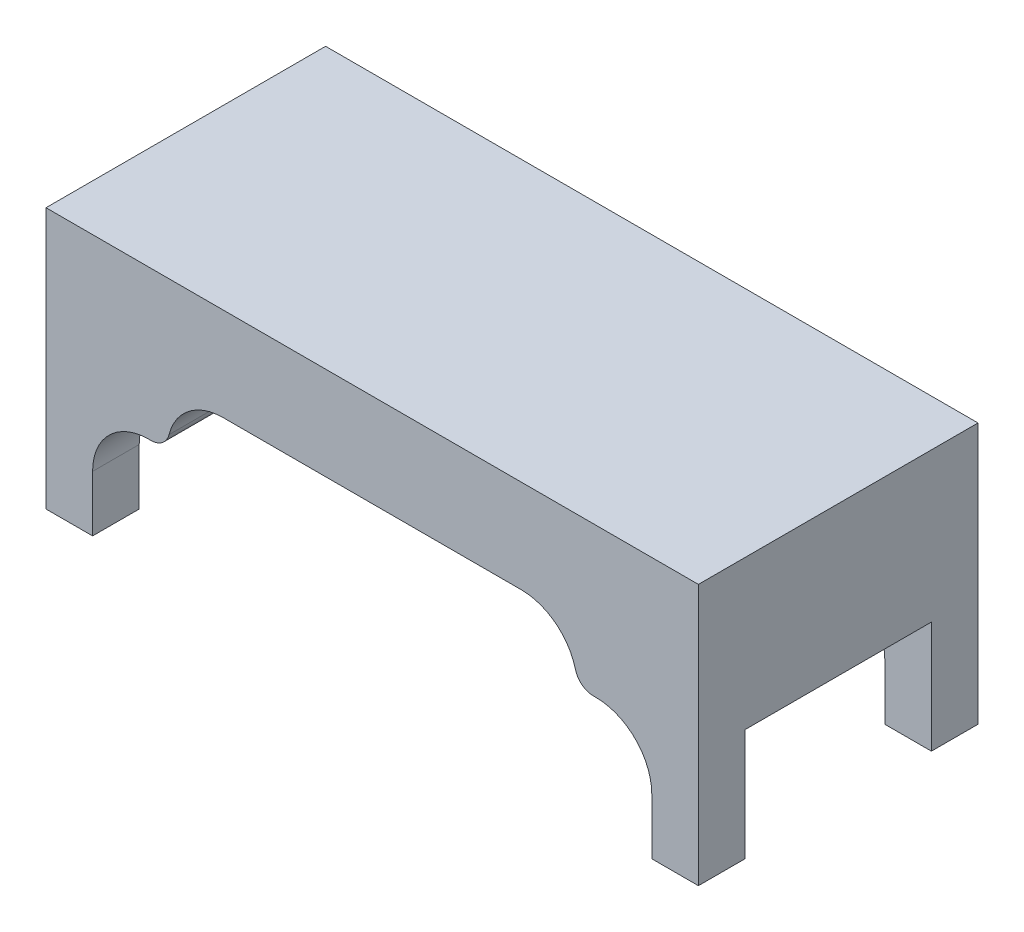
ISO-10303-21;
HEADER;
FILE_DESCRIPTION(('STEP AP214'),'2;1');
FILE_NAME('part.step','',(''),(''),'','','');
FILE_SCHEMA(('AUTOMOTIVE_DESIGN { 1 0 10303 214 1 1 1 1 }'));
ENDSEC;
DATA;
#1=APPLICATION_CONTEXT('core data for automotive mechanical design processes');
#2=APPLICATION_PROTOCOL_DEFINITION('international standard','automotive_design',2000,#1);
#3=PRODUCT_CONTEXT('',#1,'mechanical');
#4=PRODUCT('Part','Part','',(#3));
#5=PRODUCT_RELATED_PRODUCT_CATEGORY('part','',(#4));
#6=PRODUCT_DEFINITION_FORMATION('','',#4);
#7=PRODUCT_DEFINITION_CONTEXT('part definition',#1,'design');
#8=PRODUCT_DEFINITION('design','',#6,#7);
#9=PRODUCT_DEFINITION_SHAPE('','',#8);
#10=(LENGTH_UNIT() NAMED_UNIT(*) SI_UNIT(.MILLI.,.METRE.));
#11=(NAMED_UNIT(*) PLANE_ANGLE_UNIT() SI_UNIT($,.RADIAN.));
#12=(NAMED_UNIT(*) SI_UNIT($,.STERADIAN.) SOLID_ANGLE_UNIT());
#13=UNCERTAINTY_MEASURE_WITH_UNIT(LENGTH_MEASURE(1.E-05),#10,'distance_accuracy_value','');
#14=(GEOMETRIC_REPRESENTATION_CONTEXT(3) GLOBAL_UNCERTAINTY_ASSIGNED_CONTEXT((#13)) GLOBAL_UNIT_ASSIGNED_CONTEXT((#10,
#11,#12)) REPRESENTATION_CONTEXT('',''));
#15=CARTESIAN_POINT('',(0.,0.,0.));
#16=DIRECTION('',(0.,0.,1.));
#17=DIRECTION('',(1.,0.,0.));
#18=AXIS2_PLACEMENT_3D('',#15,#16,#17);
#19=CARTESIAN_POINT('',(-11.8729833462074,-0.999999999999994,15.));
#20=DIRECTION('',(0.,1.,0.));
#21=DIRECTION('',(0.,0.,1.));
#22=AXIS2_PLACEMENT_3D('',#19,#20,#21);
#23=PLANE('',#22);
#24=DIRECTION('',(-1.,0.,0.));
#25=VECTOR('',#24,1.);
#26=CARTESIAN_POINT('',(-17.5,-0.999999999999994,2.49999999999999));
#27=LINE('',#26,#25);
#28=CARTESIAN_POINT('',(-12.,-0.999999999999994,2.5));
#29=VERTEX_POINT('',#28);
#30=CARTESIAN_POINT('',(-17.5,-0.999999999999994,2.5));
#31=VERTEX_POINT('',#30);
#32=EDGE_CURVE('E501',#29,#31,#27,.T.);
#33=ORIENTED_EDGE('',*,*,#32,.F.);
#34=DIRECTION('',(0.,0.,1.));
#35=VECTOR('',#34,1.);
#36=CARTESIAN_POINT('',(-12.,-0.999999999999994,0.));
#37=LINE('',#36,#35);
#38=CARTESIAN_POINT('',(-12.,-0.999999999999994,0.));
#39=VERTEX_POINT('',#38);
#40=EDGE_CURVE('E266',#29,#39,#37,.F.);
#41=ORIENTED_EDGE('',*,*,#40,.T.);
#42=DIRECTION('',(1.,0.,0.));
#43=VECTOR('',#42,1.);
#44=CARTESIAN_POINT('',(-11.8729833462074,-0.999999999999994,0.));
#45=LINE('',#44,#43);
#46=CARTESIAN_POINT('',(-11.8729833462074,-0.999999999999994,0.));
#47=VERTEX_POINT('',#46);
#48=EDGE_CURVE('E344',#39,#47,#45,.T.);
#49=ORIENTED_EDGE('',*,*,#48,.T.);
#50=DIRECTION('',(0.,0.,-1.));
#51=VECTOR('',#50,1.);
#52=CARTESIAN_POINT('',(-11.8729833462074,-0.999999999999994,15.));
#53=LINE('',#52,#51);
#54=CARTESIAN_POINT('',(-11.8729833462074,-0.999999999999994,15.));
#55=VERTEX_POINT('',#54);
#56=EDGE_CURVE('E233',#55,#47,#53,.T.);
#57=ORIENTED_EDGE('',*,*,#56,.F.);
#58=DIRECTION('',(1.,0.,0.));
#59=VECTOR('',#58,1.);
#60=CARTESIAN_POINT('',(-11.8729833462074,-0.999999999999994,15.));
#61=LINE('',#60,#59);
#62=CARTESIAN_POINT('',(-12.,-0.999999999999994,15.));
#63=VERTEX_POINT('',#62);
#64=EDGE_CURVE('E239',#63,#55,#61,.T.);
#65=ORIENTED_EDGE('',*,*,#64,.F.);
#66=DIRECTION('',(0.,0.,1.));
#67=VECTOR('',#66,1.);
#68=CARTESIAN_POINT('',(-12.,-0.999999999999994,12.5));
#69=LINE('',#68,#67);
#70=CARTESIAN_POINT('',(-12.,-0.999999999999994,12.5));
#71=VERTEX_POINT('',#70);
#72=EDGE_CURVE('E223',#63,#71,#69,.F.);
#73=ORIENTED_EDGE('',*,*,#72,.T.);
#74=DIRECTION('',(1.,0.,0.));
#75=VECTOR('',#74,1.);
#76=CARTESIAN_POINT('',(-15.,-0.999999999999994,12.5));
#77=LINE('',#76,#75);
#78=CARTESIAN_POINT('',(-17.5,-0.999999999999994,12.5));
#79=VERTEX_POINT('',#78);
#80=EDGE_CURVE('E208',#79,#71,#77,.T.);
#81=ORIENTED_EDGE('',*,*,#80,.F.);
#82=DIRECTION('',(0.,0.,-1.));
#83=VECTOR('',#82,1.);
#84=CARTESIAN_POINT('',(-17.5,-0.999999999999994,15.));
#85=LINE('',#84,#83);
#86=EDGE_CURVE('E219',#79,#31,#85,.T.);
#87=ORIENTED_EDGE('',*,*,#86,.T.);
#88=EDGE_LOOP('',(#33,#41,#49,#57,#65,#73,#81,#87));
#89=FACE_BOUND('',#88,.T.);
#90=ADVANCED_FACE('F33',(#89),#23,.F.);
#91=CARTESIAN_POINT('',(17.5,-0.999999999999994,15.));
#92=DIRECTION('',(0.,1.,0.));
#93=DIRECTION('',(-1.,0.,0.));
#94=AXIS2_PLACEMENT_3D('',#91,#92,#93);
#95=PLANE('',#94);
#96=DIRECTION('',(1.,0.,0.));
#97=VECTOR('',#96,1.);
#98=CARTESIAN_POINT('',(15.,-0.999999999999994,12.5));
#99=LINE('',#98,#97);
#100=CARTESIAN_POINT('',(12.,-0.999999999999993,12.5));
#101=VERTEX_POINT('',#100);
#102=CARTESIAN_POINT('',(17.5,-0.999999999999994,12.5));
#103=VERTEX_POINT('',#102);
#104=EDGE_CURVE('E442',#101,#103,#99,.T.);
#105=ORIENTED_EDGE('',*,*,#104,.F.);
#106=DIRECTION('',(0.,0.,-1.));
#107=VECTOR('',#106,1.);
#108=CARTESIAN_POINT('',(12.,-0.999999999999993,15.));
#109=LINE('',#108,#107);
#110=CARTESIAN_POINT('',(12.,-0.999999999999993,15.));
#111=VERTEX_POINT('',#110);
#112=EDGE_CURVE('E277',#101,#111,#109,.F.);
#113=ORIENTED_EDGE('',*,*,#112,.T.);
#114=DIRECTION('',(1.,0.,0.));
#115=VECTOR('',#114,1.);
#116=CARTESIAN_POINT('',(17.5,-0.999999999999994,15.));
#117=LINE('',#116,#115);
#118=CARTESIAN_POINT('',(11.8729833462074,-0.999999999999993,15.));
#119=VERTEX_POINT('',#118);
#120=EDGE_CURVE('E362',#119,#111,#117,.T.);
#121=ORIENTED_EDGE('',*,*,#120,.F.);
#122=DIRECTION('',(0.,0.,-1.));
#123=VECTOR('',#122,1.);
#124=CARTESIAN_POINT('',(11.8729833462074,-0.999999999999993,15.));
#125=LINE('',#124,#123);
#126=CARTESIAN_POINT('',(11.8729833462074,-0.999999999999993,0.));
#127=VERTEX_POINT('',#126);
#128=EDGE_CURVE('E247',#119,#127,#125,.T.);
#129=ORIENTED_EDGE('',*,*,#128,.T.);
#130=DIRECTION('',(1.,0.,0.));
#131=VECTOR('',#130,1.);
#132=CARTESIAN_POINT('',(17.5,-0.999999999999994,0.));
#133=LINE('',#132,#131);
#134=CARTESIAN_POINT('',(12.,-0.999999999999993,0.));
#135=VERTEX_POINT('',#134);
#136=EDGE_CURVE('E303',#127,#135,#133,.T.);
#137=ORIENTED_EDGE('',*,*,#136,.T.);
#138=DIRECTION('',(0.,0.,-1.));
#139=VECTOR('',#138,1.);
#140=CARTESIAN_POINT('',(12.,-0.999999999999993,2.5));
#141=LINE('',#140,#139);
#142=CARTESIAN_POINT('',(12.,-0.999999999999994,2.5));
#143=VERTEX_POINT('',#142);
#144=EDGE_CURVE('E274',#135,#143,#141,.F.);
#145=ORIENTED_EDGE('',*,*,#144,.T.);
#146=DIRECTION('',(-1.,0.,0.));
#147=VECTOR('',#146,1.);
#148=CARTESIAN_POINT('',(17.5,-0.999999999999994,2.5));
#149=LINE('',#148,#147);
#150=CARTESIAN_POINT('',(17.5,-0.999999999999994,2.5));
#151=VERTEX_POINT('',#150);
#152=EDGE_CURVE('E419',#151,#143,#149,.T.);
#153=ORIENTED_EDGE('',*,*,#152,.F.);
#154=DIRECTION('',(0.,0.,-1.));
#155=VECTOR('',#154,1.);
#156=CARTESIAN_POINT('',(17.5,-0.999999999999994,15.));
#157=LINE('',#156,#155);
#158=EDGE_CURVE('E245',#103,#151,#157,.T.);
#159=ORIENTED_EDGE('',*,*,#158,.F.);
#160=EDGE_LOOP('',(#105,#113,#121,#129,#137,#145,#153,#159));
#161=FACE_BOUND('',#160,.T.);
#162=ADVANCED_FACE('F308',(#161),#95,.F.);
#163=CARTESIAN_POINT('',(-11.8729833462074,0.,15.));
#164=DIRECTION('',(0.,0.,-1.));
#165=DIRECTION('',(-1.,0.,0.));
#166=AXIS2_PLACEMENT_3D('',#163,#164,#165);
#167=CYLINDRICAL_SURFACE('',#166,1.);
#168=CARTESIAN_POINT('',(-11.8729833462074,0.,0.));
#169=DIRECTION('',(0.,0.,1.));
#170=DIRECTION('',(1.,0.,0.));
#171=AXIS2_PLACEMENT_3D('',#168,#169,#170);
#172=CIRCLE('',#171,1.);
#173=CARTESIAN_POINT('',(-10.9047375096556,-0.249999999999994,0.));
#174=VERTEX_POINT('',#173);
#175=EDGE_CURVE('E324',#47,#174,#172,.T.);
#176=ORIENTED_EDGE('',*,*,#175,.T.);
#177=DIRECTION('',(0.,0.,-1.));
#178=VECTOR('',#177,1.);
#179=CARTESIAN_POINT('',(-10.9047375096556,-0.249999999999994,15.));
#180=LINE('',#179,#178);
#181=CARTESIAN_POINT('',(-10.9047375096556,-0.249999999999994,15.));
#182=VERTEX_POINT('',#181);
#183=EDGE_CURVE('E259',#182,#174,#180,.T.);
#184=ORIENTED_EDGE('',*,*,#183,.F.);
#185=CARTESIAN_POINT('',(-11.8729833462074,0.,15.));
#186=DIRECTION('',(0.,0.,1.));
#187=DIRECTION('',(1.,0.,0.));
#188=AXIS2_PLACEMENT_3D('',#185,#186,#187);
#189=CIRCLE('',#188,1.);
#190=EDGE_CURVE('E346',#55,#182,#189,.T.);
#191=ORIENTED_EDGE('',*,*,#190,.F.);
#192=ORIENTED_EDGE('',*,*,#56,.T.);
#193=EDGE_LOOP('',(#176,#184,#191,#192));
#194=FACE_BOUND('',#193,.T.);
#195=ADVANCED_FACE('F35',(#194),#167,.T.);
#196=CARTESIAN_POINT('',(-8.,-0.999999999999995,15.));
#197=DIRECTION('',(0.,0.,-1.));
#198=DIRECTION('',(-1.,0.,0.));
#199=AXIS2_PLACEMENT_3D('',#196,#197,#198);
#200=CYLINDRICAL_SURFACE('',#199,3.);
#201=CARTESIAN_POINT('',(-8.,-0.999999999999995,0.));
#202=DIRECTION('',(0.,0.,-1.));
#203=DIRECTION('',(1.,0.,0.));
#204=AXIS2_PLACEMENT_3D('',#201,#202,#203);
#205=CIRCLE('',#204,3.);
#206=CARTESIAN_POINT('',(-8.,2.,0.));
#207=VERTEX_POINT('',#206);
#208=EDGE_CURVE('E332',#174,#207,#205,.T.);
#209=ORIENTED_EDGE('',*,*,#208,.T.);
#210=DIRECTION('',(0.,0.,-1.));
#211=VECTOR('',#210,1.);
#212=CARTESIAN_POINT('',(-8.,2.,15.));
#213=LINE('',#212,#211);
#214=CARTESIAN_POINT('',(-8.,2.,15.));
#215=VERTEX_POINT('',#214);
#216=EDGE_CURVE('E256',#215,#207,#213,.T.);
#217=ORIENTED_EDGE('',*,*,#216,.F.);
#218=CARTESIAN_POINT('',(-8.,-0.999999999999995,15.));
#219=DIRECTION('',(0.,0.,-1.));
#220=DIRECTION('',(1.,0.,0.));
#221=AXIS2_PLACEMENT_3D('',#218,#219,#220);
#222=CIRCLE('',#221,3.);
#223=EDGE_CURVE('E350',#182,#215,#222,.T.);
#224=ORIENTED_EDGE('',*,*,#223,.F.);
#225=ORIENTED_EDGE('',*,*,#183,.T.);
#226=EDGE_LOOP('',(#209,#217,#224,#225));
#227=FACE_BOUND('',#226,.T.);
#228=ADVANCED_FACE('F385',(#227),#200,.F.);
#229=CARTESIAN_POINT('',(-8.,2.,15.));
#230=DIRECTION('',(0.,1.,0.));
#231=DIRECTION('',(-1.,0.,0.));
#232=AXIS2_PLACEMENT_3D('',#229,#230,#231);
#233=PLANE('',#232);
#234=DIRECTION('',(1.,0.,0.));
#235=VECTOR('',#234,1.);
#236=CARTESIAN_POINT('',(-8.,2.,0.));
#237=LINE('',#236,#235);
#238=CARTESIAN_POINT('',(8.,2.,0.));
#239=VERTEX_POINT('',#238);
#240=EDGE_CURVE('E334',#207,#239,#237,.T.);
#241=ORIENTED_EDGE('',*,*,#240,.T.);
#242=DIRECTION('',(0.,0.,-1.));
#243=VECTOR('',#242,1.);
#244=CARTESIAN_POINT('',(8.,2.,15.));
#245=LINE('',#244,#243);
#246=CARTESIAN_POINT('',(8.,2.,15.));
#247=VERTEX_POINT('',#246);
#248=EDGE_CURVE('E253',#247,#239,#245,.T.);
#249=ORIENTED_EDGE('',*,*,#248,.F.);
#250=DIRECTION('',(1.,0.,0.));
#251=VECTOR('',#250,1.);
#252=CARTESIAN_POINT('',(-8.,2.,15.));
#253=LINE('',#252,#251);
#254=EDGE_CURVE('E353',#215,#247,#253,.T.);
#255=ORIENTED_EDGE('',*,*,#254,.F.);
#256=ORIENTED_EDGE('',*,*,#216,.T.);
#257=EDGE_LOOP('',(#241,#249,#255,#256));
#258=FACE_BOUND('',#257,.T.);
#259=ADVANCED_FACE('F392',(#258),#233,.F.);
#260=CARTESIAN_POINT('',(8.,-0.999999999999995,15.));
#261=DIRECTION('',(0.,0.,-1.));
#262=DIRECTION('',(-1.,0.,0.));
#263=AXIS2_PLACEMENT_3D('',#260,#261,#262);
#264=CYLINDRICAL_SURFACE('',#263,3.);
#265=CARTESIAN_POINT('',(8.,-0.999999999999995,0.));
#266=DIRECTION('',(0.,0.,-1.));
#267=DIRECTION('',(1.,0.,0.));
#268=AXIS2_PLACEMENT_3D('',#265,#266,#267);
#269=CIRCLE('',#268,3.);
#270=CARTESIAN_POINT('',(10.9047375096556,-0.249999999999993,0.));
#271=VERTEX_POINT('',#270);
#272=EDGE_CURVE('E336',#239,#271,#269,.T.);
#273=ORIENTED_EDGE('',*,*,#272,.T.);
#274=DIRECTION('',(0.,0.,-1.));
#275=VECTOR('',#274,1.);
#276=CARTESIAN_POINT('',(10.9047375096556,-0.249999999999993,15.));
#277=LINE('',#276,#275);
#278=CARTESIAN_POINT('',(10.9047375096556,-0.249999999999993,15.));
#279=VERTEX_POINT('',#278);
#280=EDGE_CURVE('E250',#279,#271,#277,.T.);
#281=ORIENTED_EDGE('',*,*,#280,.F.);
#282=CARTESIAN_POINT('',(8.,-0.999999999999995,15.));
#283=DIRECTION('',(0.,0.,-1.));
#284=DIRECTION('',(1.,0.,0.));
#285=AXIS2_PLACEMENT_3D('',#282,#283,#284);
#286=CIRCLE('',#285,3.);
#287=EDGE_CURVE('E356',#247,#279,#286,.T.);
#288=ORIENTED_EDGE('',*,*,#287,.F.);
#289=ORIENTED_EDGE('',*,*,#248,.T.);
#290=EDGE_LOOP('',(#273,#281,#288,#289));
#291=FACE_BOUND('',#290,.T.);
#292=ADVANCED_FACE('F396',(#291),#264,.F.);
#293=CARTESIAN_POINT('',(11.8729833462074,0.,15.));
#294=DIRECTION('',(0.,0.,-1.));
#295=DIRECTION('',(-1.,0.,0.));
#296=AXIS2_PLACEMENT_3D('',#293,#294,#295);
#297=CYLINDRICAL_SURFACE('',#296,1.);
#298=CARTESIAN_POINT('',(11.8729833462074,0.,0.));
#299=DIRECTION('',(0.,0.,1.));
#300=DIRECTION('',(1.,0.,0.));
#301=AXIS2_PLACEMENT_3D('',#298,#299,#300);
#302=CIRCLE('',#301,1.);
#303=EDGE_CURVE('E313',#271,#127,#302,.T.);
#304=ORIENTED_EDGE('',*,*,#303,.T.);
#305=ORIENTED_EDGE('',*,*,#128,.F.);
#306=CARTESIAN_POINT('',(11.8729833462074,0.,15.));
#307=DIRECTION('',(0.,0.,1.));
#308=DIRECTION('',(1.,0.,0.));
#309=AXIS2_PLACEMENT_3D('',#306,#307,#308);
#310=CIRCLE('',#309,1.);
#311=EDGE_CURVE('E359',#279,#119,#310,.T.);
#312=ORIENTED_EDGE('',*,*,#311,.F.);
#313=ORIENTED_EDGE('',*,*,#280,.T.);
#314=EDGE_LOOP('',(#304,#305,#312,#313));
#315=FACE_BOUND('',#314,.T.);
#316=ADVANCED_FACE('F399',(#315),#297,.T.);
#317=CARTESIAN_POINT('',(17.5,7.,15.));
#318=DIRECTION('',(-1.,0.,0.));
#319=DIRECTION('',(0.,0.,1.));
#320=AXIS2_PLACEMENT_3D('',#317,#318,#319);
#321=PLANE('',#320);
#322=DIRECTION('',(0.,1.,0.));
#323=VECTOR('',#322,1.);
#324=CARTESIAN_POINT('',(17.5,7.,0.));
#325=LINE('',#324,#323);
#326=CARTESIAN_POINT('',(17.5,-6.99999999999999,0.));
#327=VERTEX_POINT('',#326);
#328=CARTESIAN_POINT('',(17.5,7.,0.));
#329=VERTEX_POINT('',#328);
#330=EDGE_CURVE('E312',#327,#329,#325,.T.);
#331=ORIENTED_EDGE('',*,*,#330,.T.);
#332=DIRECTION('',(0.,0.,-1.));
#333=VECTOR('',#332,1.);
#334=CARTESIAN_POINT('',(17.5,7.,15.));
#335=LINE('',#334,#333);
#336=CARTESIAN_POINT('',(17.5,7.,15.));
#337=VERTEX_POINT('',#336);
#338=EDGE_CURVE('E236',#337,#329,#335,.T.);
#339=ORIENTED_EDGE('',*,*,#338,.F.);
#340=DIRECTION('',(0.,1.,0.));
#341=VECTOR('',#340,1.);
#342=CARTESIAN_POINT('',(17.5,7.,15.));
#343=LINE('',#342,#341);
#344=CARTESIAN_POINT('',(17.5,-6.99999999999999,15.));
#345=VERTEX_POINT('',#344);
#346=EDGE_CURVE('E366',#345,#337,#343,.T.);
#347=ORIENTED_EDGE('',*,*,#346,.F.);
#348=DIRECTION('',(0.,0.,1.));
#349=VECTOR('',#348,1.);
#350=CARTESIAN_POINT('',(17.5,-6.99999999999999,15.));
#351=LINE('',#350,#349);
#352=CARTESIAN_POINT('',(17.5,-6.99999999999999,12.5));
#353=VERTEX_POINT('',#352);
#354=EDGE_CURVE('E453',#353,#345,#351,.T.);
#355=ORIENTED_EDGE('',*,*,#354,.F.);
#356=DIRECTION('',(0.,1.,0.));
#357=VECTOR('',#356,1.);
#358=CARTESIAN_POINT('',(17.5,-6.99999999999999,12.5));
#359=LINE('',#358,#357);
#360=EDGE_CURVE('E420',#353,#103,#359,.T.);
#361=ORIENTED_EDGE('',*,*,#360,.T.);
#362=ORIENTED_EDGE('',*,*,#158,.T.);
#363=DIRECTION('',(0.,1.,0.));
#364=VECTOR('',#363,1.);
#365=CARTESIAN_POINT('',(17.5,-6.99999999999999,2.5));
#366=LINE('',#365,#364);
#367=CARTESIAN_POINT('',(17.5,-6.99999999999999,2.5));
#368=VERTEX_POINT('',#367);
#369=EDGE_CURVE('E321',#368,#151,#366,.T.);
#370=ORIENTED_EDGE('',*,*,#369,.F.);
#371=DIRECTION('',(0.,0.,1.));
#372=VECTOR('',#371,1.);
#373=CARTESIAN_POINT('',(17.5,-6.99999999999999,2.5));
#374=LINE('',#373,#372);
#375=EDGE_CURVE('E422',#327,#368,#374,.T.);
#376=ORIENTED_EDGE('',*,*,#375,.F.);
#377=EDGE_LOOP('',(#331,#339,#347,#355,#361,#362,#370,#376));
#378=FACE_BOUND('',#377,.T.);
#379=ADVANCED_FACE('F438',(#378),#321,.F.);
#380=CARTESIAN_POINT('',(-17.5,7.,15.));
#381=DIRECTION('',(0.,-1.,0.));
#382=DIRECTION('',(0.,0.,-1.));
#383=AXIS2_PLACEMENT_3D('',#380,#381,#382);
#384=PLANE('',#383);
#385=DIRECTION('',(-1.,0.,0.));
#386=VECTOR('',#385,1.);
#387=CARTESIAN_POINT('',(-17.5,7.,0.));
#388=LINE('',#387,#386);
#389=CARTESIAN_POINT('',(-17.5,7.,0.));
#390=VERTEX_POINT('',#389);
#391=EDGE_CURVE('E340',#329,#390,#388,.T.);
#392=ORIENTED_EDGE('',*,*,#391,.T.);
#393=DIRECTION('',(0.,0.,-1.));
#394=VECTOR('',#393,1.);
#395=CARTESIAN_POINT('',(-17.5,7.,15.));
#396=LINE('',#395,#394);
#397=CARTESIAN_POINT('',(-17.5,7.,15.));
#398=VERTEX_POINT('',#397);
#399=EDGE_CURVE('E232',#398,#390,#396,.T.);
#400=ORIENTED_EDGE('',*,*,#399,.F.);
#401=DIRECTION('',(-1.,0.,0.));
#402=VECTOR('',#401,1.);
#403=CARTESIAN_POINT('',(-17.5,7.,15.));
#404=LINE('',#403,#402);
#405=EDGE_CURVE('E369',#337,#398,#404,.T.);
#406=ORIENTED_EDGE('',*,*,#405,.F.);
#407=ORIENTED_EDGE('',*,*,#338,.T.);
#408=EDGE_LOOP('',(#392,#400,#406,#407));
#409=FACE_BOUND('',#408,.T.);
#410=ADVANCED_FACE('F479',(#409),#384,.F.);
#411=CARTESIAN_POINT('',(-17.5,-0.999999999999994,15.));
#412=DIRECTION('',(1.,0.,0.));
#413=DIRECTION('',(0.,0.,-1.));
#414=AXIS2_PLACEMENT_3D('',#411,#412,#413);
#415=PLANE('',#414);
#416=DIRECTION('',(0.,-1.,0.));
#417=VECTOR('',#416,1.);
#418=CARTESIAN_POINT('',(-17.5,-0.999999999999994,0.));
#419=LINE('',#418,#417);
#420=CARTESIAN_POINT('',(-17.5,-6.99999999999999,0.));
#421=VERTEX_POINT('',#420);
#422=EDGE_CURVE('E342',#390,#421,#419,.T.);
#423=ORIENTED_EDGE('',*,*,#422,.T.);
#424=DIRECTION('',(0.,0.,-1.));
#425=VECTOR('',#424,1.);
#426=CARTESIAN_POINT('',(-17.5,-6.99999999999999,0.));
#427=LINE('',#426,#425);
#428=CARTESIAN_POINT('',(-17.5,-6.99999999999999,2.49999999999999));
#429=VERTEX_POINT('',#428);
#430=EDGE_CURVE('E503',#429,#421,#427,.T.);
#431=ORIENTED_EDGE('',*,*,#430,.F.);
#432=DIRECTION('',(0.,1.,0.));
#433=VECTOR('',#432,1.);
#434=CARTESIAN_POINT('',(-17.5,-6.99999999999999,2.49999999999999));
#435=LINE('',#434,#433);
#436=EDGE_CURVE('E231',#429,#31,#435,.T.);
#437=ORIENTED_EDGE('',*,*,#436,.T.);
#438=ORIENTED_EDGE('',*,*,#86,.F.);
#439=DIRECTION('',(0.,1.,0.));
#440=VECTOR('',#439,1.);
#441=CARTESIAN_POINT('',(-17.5,-6.99999999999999,12.5));
#442=LINE('',#441,#440);
#443=CARTESIAN_POINT('',(-17.5,-6.99999999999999,12.5));
#444=VERTEX_POINT('',#443);
#445=EDGE_CURVE('E205',#444,#79,#442,.T.);
#446=ORIENTED_EDGE('',*,*,#445,.F.);
#447=DIRECTION('',(0.,0.,-1.));
#448=VECTOR('',#447,1.);
#449=CARTESIAN_POINT('',(-17.5,-6.99999999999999,15.));
#450=LINE('',#449,#448);
#451=CARTESIAN_POINT('',(-17.5,-6.99999999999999,15.));
#452=VERTEX_POINT('',#451);
#453=EDGE_CURVE('E482',#452,#444,#450,.T.);
#454=ORIENTED_EDGE('',*,*,#453,.F.);
#455=DIRECTION('',(0.,-1.,0.));
#456=VECTOR('',#455,1.);
#457=CARTESIAN_POINT('',(-17.5,-0.999999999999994,15.));
#458=LINE('',#457,#456);
#459=EDGE_CURVE('E372',#398,#452,#458,.T.);
#460=ORIENTED_EDGE('',*,*,#459,.F.);
#461=ORIENTED_EDGE('',*,*,#399,.T.);
#462=EDGE_LOOP('',(#423,#431,#437,#438,#446,#454,#460,#461));
#463=FACE_BOUND('',#462,.T.);
#464=ADVANCED_FACE('F228',(#463),#415,.F.);
#465=CARTESIAN_POINT('',(-11.8729833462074,0.,15.));
#466=DIRECTION('',(0.,0.,1.));
#467=DIRECTION('',(1.,0.,0.));
#468=AXIS2_PLACEMENT_3D('',#465,#466,#467);
#469=PLANE('',#468);
#470=ORIENTED_EDGE('',*,*,#190,.T.);
#471=ORIENTED_EDGE('',*,*,#223,.T.);
#472=ORIENTED_EDGE('',*,*,#254,.T.);
#473=ORIENTED_EDGE('',*,*,#287,.T.);
#474=ORIENTED_EDGE('',*,*,#311,.T.);
#475=ORIENTED_EDGE('',*,*,#120,.T.);
#476=CARTESIAN_POINT('',(12.,-3.99999999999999,15.));
#477=DIRECTION('',(0.,0.,1.));
#478=DIRECTION('',(1.,0.,0.));
#479=AXIS2_PLACEMENT_3D('',#476,#477,#478);
#480=CIRCLE('',#479,3.);
#481=CARTESIAN_POINT('',(15.,-3.99999999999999,15.));
#482=VERTEX_POINT('',#481);
#483=EDGE_CURVE('E294',#111,#482,#480,.F.);
#484=ORIENTED_EDGE('',*,*,#483,.T.);
#485=DIRECTION('',(0.,1.,0.));
#486=VECTOR('',#485,1.);
#487=CARTESIAN_POINT('',(15.,-6.99999999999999,15.));
#488=LINE('',#487,#486);
#489=CARTESIAN_POINT('',(15.,-6.99999999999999,15.));
#490=VERTEX_POINT('',#489);
#491=EDGE_CURVE('E413',#490,#482,#488,.T.);
#492=ORIENTED_EDGE('',*,*,#491,.F.);
#493=DIRECTION('',(-1.,0.,0.));
#494=VECTOR('',#493,1.);
#495=CARTESIAN_POINT('',(15.,-6.99999999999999,15.));
#496=LINE('',#495,#494);
#497=EDGE_CURVE('E456',#345,#490,#496,.T.);
#498=ORIENTED_EDGE('',*,*,#497,.F.);
#499=ORIENTED_EDGE('',*,*,#346,.T.);
#500=ORIENTED_EDGE('',*,*,#405,.T.);
#501=ORIENTED_EDGE('',*,*,#459,.T.);
#502=DIRECTION('',(-1.,0.,0.));
#503=VECTOR('',#502,1.);
#504=CARTESIAN_POINT('',(-15.,-6.99999999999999,15.));
#505=LINE('',#504,#503);
#506=CARTESIAN_POINT('',(-15.,-6.99999999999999,15.));
#507=VERTEX_POINT('',#506);
#508=EDGE_CURVE('E484',#507,#452,#505,.T.);
#509=ORIENTED_EDGE('',*,*,#508,.F.);
#510=DIRECTION('',(0.,1.,0.));
#511=VECTOR('',#510,1.);
#512=CARTESIAN_POINT('',(-15.,-6.99999999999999,15.));
#513=LINE('',#512,#511);
#514=CARTESIAN_POINT('',(-15.,-3.99999999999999,15.));
#515=VERTEX_POINT('',#514);
#516=EDGE_CURVE('E215',#507,#515,#513,.T.);
#517=ORIENTED_EDGE('',*,*,#516,.T.);
#518=CARTESIAN_POINT('',(-12.,-3.99999999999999,15.));
#519=DIRECTION('',(0.,0.,1.));
#520=DIRECTION('',(1.,0.,0.));
#521=AXIS2_PLACEMENT_3D('',#518,#519,#520);
#522=CIRCLE('',#521,3.);
#523=EDGE_CURVE('E286',#515,#63,#522,.F.);
#524=ORIENTED_EDGE('',*,*,#523,.T.);
#525=ORIENTED_EDGE('',*,*,#64,.T.);
#526=EDGE_LOOP('',(#470,#471,#472,#473,#474,#475,#484,#492,#498,#499,#500,#501,#509,#517,#524,#525));
#527=FACE_BOUND('',#526,.T.);
#528=ADVANCED_FACE('F378',(#527),#469,.T.);
#529=CARTESIAN_POINT('',(-11.8729833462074,0.,0.));
#530=DIRECTION('',(0.,0.,1.));
#531=DIRECTION('',(1.,0.,0.));
#532=AXIS2_PLACEMENT_3D('',#529,#530,#531);
#533=PLANE('',#532);
#534=ORIENTED_EDGE('',*,*,#175,.F.);
#535=ORIENTED_EDGE('',*,*,#48,.F.);
#536=CARTESIAN_POINT('',(-12.,-3.99999999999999,0.));
#537=DIRECTION('',(0.,0.,1.));
#538=DIRECTION('',(1.,0.,0.));
#539=AXIS2_PLACEMENT_3D('',#536,#537,#538);
#540=CIRCLE('',#539,3.);
#541=CARTESIAN_POINT('',(-15.,-3.99999999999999,0.));
#542=VERTEX_POINT('',#541);
#543=EDGE_CURVE('E284',#39,#542,#540,.T.);
#544=ORIENTED_EDGE('',*,*,#543,.T.);
#545=DIRECTION('',(0.,1.,0.));
#546=VECTOR('',#545,1.);
#547=CARTESIAN_POINT('',(-15.,-6.99999999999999,0.));
#548=LINE('',#547,#546);
#549=CARTESIAN_POINT('',(-15.,-6.99999999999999,0.));
#550=VERTEX_POINT('',#549);
#551=EDGE_CURVE('E444',#550,#542,#548,.T.);
#552=ORIENTED_EDGE('',*,*,#551,.F.);
#553=DIRECTION('',(1.,0.,0.));
#554=VECTOR('',#553,1.);
#555=CARTESIAN_POINT('',(-17.5,-6.99999999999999,0.));
#556=LINE('',#555,#554);
#557=EDGE_CURVE('E506',#421,#550,#556,.T.);
#558=ORIENTED_EDGE('',*,*,#557,.F.);
#559=ORIENTED_EDGE('',*,*,#422,.F.);
#560=ORIENTED_EDGE('',*,*,#391,.F.);
#561=ORIENTED_EDGE('',*,*,#330,.F.);
#562=DIRECTION('',(1.,0.,0.));
#563=VECTOR('',#562,1.);
#564=CARTESIAN_POINT('',(17.5,-6.99999999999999,0.));
#565=LINE('',#564,#563);
#566=CARTESIAN_POINT('',(15.,-6.99999999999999,0.));
#567=VERTEX_POINT('',#566);
#568=EDGE_CURVE('E326',#567,#327,#565,.T.);
#569=ORIENTED_EDGE('',*,*,#568,.F.);
#570=DIRECTION('',(0.,1.,0.));
#571=VECTOR('',#570,1.);
#572=CARTESIAN_POINT('',(15.,-6.99999999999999,0.));
#573=LINE('',#572,#571);
#574=CARTESIAN_POINT('',(15.,-3.99999999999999,0.));
#575=VERTEX_POINT('',#574);
#576=EDGE_CURVE('E306',#567,#575,#573,.T.);
#577=ORIENTED_EDGE('',*,*,#576,.T.);
#578=CARTESIAN_POINT('',(12.,-3.99999999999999,0.));
#579=DIRECTION('',(0.,0.,1.));
#580=DIRECTION('',(1.,0.,0.));
#581=AXIS2_PLACEMENT_3D('',#578,#579,#580);
#582=CIRCLE('',#581,3.);
#583=EDGE_CURVE('E41',#575,#135,#582,.T.);
#584=ORIENTED_EDGE('',*,*,#583,.T.);
#585=ORIENTED_EDGE('',*,*,#136,.F.);
#586=ORIENTED_EDGE('',*,*,#303,.F.);
#587=ORIENTED_EDGE('',*,*,#272,.F.);
#588=ORIENTED_EDGE('',*,*,#240,.F.);
#589=ORIENTED_EDGE('',*,*,#208,.F.);
#590=EDGE_LOOP('',(#534,#535,#544,#552,#558,#559,#560,#561,#569,#577,#584,#585,#586,#587,#588,#589));
#591=FACE_BOUND('',#590,.T.);
#592=ADVANCED_FACE('F301',(#591),#533,.F.);
#593=CARTESIAN_POINT('',(17.5,-6.99999999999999,2.5));
#594=DIRECTION('',(0.,0.,-1.));
#595=DIRECTION('',(-1.,0.,0.));
#596=AXIS2_PLACEMENT_3D('',#593,#594,#595);
#597=PLANE('',#596);
#598=ORIENTED_EDGE('',*,*,#152,.T.);
#599=CARTESIAN_POINT('',(12.,-3.99999999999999,2.5));
#600=DIRECTION('',(0.,0.,-1.));
#601=DIRECTION('',(-1.,0.,0.));
#602=AXIS2_PLACEMENT_3D('',#599,#600,#601);
#603=CIRCLE('',#602,3.);
#604=CARTESIAN_POINT('',(15.,-3.99999999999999,2.5));
#605=VERTEX_POINT('',#604);
#606=EDGE_CURVE('E11',#143,#605,#603,.T.);
#607=ORIENTED_EDGE('',*,*,#606,.T.);
#608=DIRECTION('',(0.,1.,0.));
#609=VECTOR('',#608,1.);
#610=CARTESIAN_POINT('',(15.,-6.99999999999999,2.5));
#611=LINE('',#610,#609);
#612=CARTESIAN_POINT('',(15.,-6.99999999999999,2.5));
#613=VERTEX_POINT('',#612);
#614=EDGE_CURVE('E319',#613,#605,#611,.T.);
#615=ORIENTED_EDGE('',*,*,#614,.F.);
#616=DIRECTION('',(-1.,0.,0.));
#617=VECTOR('',#616,1.);
#618=CARTESIAN_POINT('',(17.5,-6.99999999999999,2.5));
#619=LINE('',#618,#617);
#620=EDGE_CURVE('E430',#368,#613,#619,.T.);
#621=ORIENTED_EDGE('',*,*,#620,.F.);
#622=ORIENTED_EDGE('',*,*,#369,.T.);
#623=EDGE_LOOP('',(#598,#607,#615,#621,#622));
#624=FACE_BOUND('',#623,.T.);
#625=ADVANCED_FACE('F441',(#624),#597,.F.);
#626=CARTESIAN_POINT('',(15.,-6.99999999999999,2.5));
#627=DIRECTION('',(1.,0.,0.));
#628=DIRECTION('',(0.,0.,-1.));
#629=AXIS2_PLACEMENT_3D('',#626,#627,#628);
#630=PLANE('',#629);
#631=ORIENTED_EDGE('',*,*,#614,.T.);
#632=DIRECTION('',(0.,0.,-1.));
#633=VECTOR('',#632,1.);
#634=CARTESIAN_POINT('',(15.,-3.99999999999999,0.));
#635=LINE('',#634,#633);
#636=EDGE_CURVE('E279',#605,#575,#635,.T.);
#637=ORIENTED_EDGE('',*,*,#636,.T.);
#638=ORIENTED_EDGE('',*,*,#576,.F.);
#639=DIRECTION('',(0.,0.,-1.));
#640=VECTOR('',#639,1.);
#641=CARTESIAN_POINT('',(15.,-6.99999999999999,2.5));
#642=LINE('',#641,#640);
#643=EDGE_CURVE('E320',#613,#567,#642,.T.);
#644=ORIENTED_EDGE('',*,*,#643,.F.);
#645=EDGE_LOOP('',(#631,#637,#638,#644));
#646=FACE_BOUND('',#645,.T.);
#647=ADVANCED_FACE('F317',(#646),#630,.F.);
#648=CARTESIAN_POINT('',(17.5,-6.99999999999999,2.5));
#649=DIRECTION('',(0.,1.,0.));
#650=DIRECTION('',(0.,0.,1.));
#651=AXIS2_PLACEMENT_3D('',#648,#649,#650);
#652=PLANE('',#651);
#653=ORIENTED_EDGE('',*,*,#375,.T.);
#654=ORIENTED_EDGE('',*,*,#620,.T.);
#655=ORIENTED_EDGE('',*,*,#643,.T.);
#656=ORIENTED_EDGE('',*,*,#568,.T.);
#657=EDGE_LOOP('',(#653,#654,#655,#656));
#658=FACE_BOUND('',#657,.T.);
#659=ADVANCED_FACE('F435',(#658),#652,.F.);
#660=CARTESIAN_POINT('',(15.,-6.99999999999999,15.));
#661=DIRECTION('',(1.,0.,0.));
#662=DIRECTION('',(0.,0.,-1.));
#663=AXIS2_PLACEMENT_3D('',#660,#661,#662);
#664=PLANE('',#663);
#665=ORIENTED_EDGE('',*,*,#491,.T.);
#666=DIRECTION('',(0.,0.,-1.));
#667=VECTOR('',#666,1.);
#668=CARTESIAN_POINT('',(15.,-3.99999999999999,12.5));
#669=LINE('',#668,#667);
#670=CARTESIAN_POINT('',(15.,-3.99999999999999,12.5));
#671=VERTEX_POINT('',#670);
#672=EDGE_CURVE('E271',#482,#671,#669,.T.);
#673=ORIENTED_EDGE('',*,*,#672,.T.);
#674=DIRECTION('',(0.,1.,0.));
#675=VECTOR('',#674,1.);
#676=CARTESIAN_POINT('',(15.,-6.99999999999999,12.5));
#677=LINE('',#676,#675);
#678=CARTESIAN_POINT('',(15.,-6.99999999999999,12.5));
#679=VERTEX_POINT('',#678);
#680=EDGE_CURVE('E412',#679,#671,#677,.T.);
#681=ORIENTED_EDGE('',*,*,#680,.F.);
#682=DIRECTION('',(0.,0.,-1.));
#683=VECTOR('',#682,1.);
#684=CARTESIAN_POINT('',(15.,-6.99999999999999,15.));
#685=LINE('',#684,#683);
#686=EDGE_CURVE('E443',#490,#679,#685,.T.);
#687=ORIENTED_EDGE('',*,*,#686,.F.);
#688=EDGE_LOOP('',(#665,#673,#681,#687));
#689=FACE_BOUND('',#688,.T.);
#690=ADVANCED_FACE('F410',(#689),#664,.F.);
#691=CARTESIAN_POINT('',(15.,-6.99999999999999,12.5));
#692=DIRECTION('',(0.,0.,1.));
#693=DIRECTION('',(1.,0.,0.));
#694=AXIS2_PLACEMENT_3D('',#691,#692,#693);
#695=PLANE('',#694);
#696=ORIENTED_EDGE('',*,*,#104,.T.);
#697=ORIENTED_EDGE('',*,*,#360,.F.);
#698=DIRECTION('',(1.,0.,0.));
#699=VECTOR('',#698,1.);
#700=CARTESIAN_POINT('',(15.,-6.99999999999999,12.5));
#701=LINE('',#700,#699);
#702=EDGE_CURVE('E417',#679,#353,#701,.T.);
#703=ORIENTED_EDGE('',*,*,#702,.F.);
#704=ORIENTED_EDGE('',*,*,#680,.T.);
#705=CARTESIAN_POINT('',(12.,-3.99999999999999,12.5));
#706=DIRECTION('',(0.,0.,1.));
#707=DIRECTION('',(1.,0.,0.));
#708=AXIS2_PLACEMENT_3D('',#705,#706,#707);
#709=CIRCLE('',#708,3.);
#710=EDGE_CURVE('E291',#671,#101,#709,.T.);
#711=ORIENTED_EDGE('',*,*,#710,.T.);
#712=EDGE_LOOP('',(#696,#697,#703,#704,#711));
#713=FACE_BOUND('',#712,.T.);
#714=ADVANCED_FACE('F415',(#713),#695,.F.);
#715=CARTESIAN_POINT('',(15.,-6.99999999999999,12.5));
#716=DIRECTION('',(0.,-1.,0.));
#717=DIRECTION('',(0.,0.,-1.));
#718=AXIS2_PLACEMENT_3D('',#715,#716,#717);
#719=PLANE('',#718);
#720=ORIENTED_EDGE('',*,*,#686,.T.);
#721=ORIENTED_EDGE('',*,*,#702,.T.);
#722=ORIENTED_EDGE('',*,*,#354,.T.);
#723=ORIENTED_EDGE('',*,*,#497,.T.);
#724=EDGE_LOOP('',(#720,#721,#722,#723));
#725=FACE_BOUND('',#724,.T.);
#726=ADVANCED_FACE('F473',(#725),#719,.T.);
#727=CARTESIAN_POINT('',(-15.,-6.99999999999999,0.));
#728=DIRECTION('',(-1.,0.,0.));
#729=DIRECTION('',(0.,0.,1.));
#730=AXIS2_PLACEMENT_3D('',#727,#728,#729);
#731=PLANE('',#730);
#732=ORIENTED_EDGE('',*,*,#551,.T.);
#733=DIRECTION('',(0.,0.,1.));
#734=VECTOR('',#733,1.);
#735=CARTESIAN_POINT('',(-15.,-3.99999999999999,2.5));
#736=LINE('',#735,#734);
#737=CARTESIAN_POINT('',(-15.,-3.99999999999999,2.5));
#738=VERTEX_POINT('',#737);
#739=EDGE_CURVE('E262',#542,#738,#736,.T.);
#740=ORIENTED_EDGE('',*,*,#739,.T.);
#741=DIRECTION('',(0.,1.,0.));
#742=VECTOR('',#741,1.);
#743=CARTESIAN_POINT('',(-15.,-6.99999999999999,2.5));
#744=LINE('',#743,#742);
#745=CARTESIAN_POINT('',(-15.,-6.99999999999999,2.5));
#746=VERTEX_POINT('',#745);
#747=EDGE_CURVE('E448',#746,#738,#744,.T.);
#748=ORIENTED_EDGE('',*,*,#747,.F.);
#749=DIRECTION('',(0.,0.,1.));
#750=VECTOR('',#749,1.);
#751=CARTESIAN_POINT('',(-15.,-6.99999999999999,0.));
#752=LINE('',#751,#750);
#753=EDGE_CURVE('E508',#550,#746,#752,.T.);
#754=ORIENTED_EDGE('',*,*,#753,.F.);
#755=EDGE_LOOP('',(#732,#740,#748,#754));
#756=FACE_BOUND('',#755,.T.);
#757=ADVANCED_FACE('F520',(#756),#731,.F.);
#758=CARTESIAN_POINT('',(-17.5,-6.99999999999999,2.49999999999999));
#759=DIRECTION('',(0.,0.,-1.));
#760=DIRECTION('',(-1.,0.,0.));
#761=AXIS2_PLACEMENT_3D('',#758,#759,#760);
#762=PLANE('',#761);
#763=ORIENTED_EDGE('',*,*,#32,.T.);
#764=ORIENTED_EDGE('',*,*,#436,.F.);
#765=DIRECTION('',(-1.,0.,0.));
#766=VECTOR('',#765,1.);
#767=CARTESIAN_POINT('',(-17.5,-6.99999999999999,2.49999999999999));
#768=LINE('',#767,#766);
#769=EDGE_CURVE('E510',#746,#429,#768,.T.);
#770=ORIENTED_EDGE('',*,*,#769,.F.);
#771=ORIENTED_EDGE('',*,*,#747,.T.);
#772=CARTESIAN_POINT('',(-12.,-3.99999999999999,2.5));
#773=DIRECTION('',(0.,0.,-1.));
#774=DIRECTION('',(-1.,0.,0.));
#775=AXIS2_PLACEMENT_3D('',#772,#773,#774);
#776=CIRCLE('',#775,3.);
#777=EDGE_CURVE('E281',#738,#29,#776,.T.);
#778=ORIENTED_EDGE('',*,*,#777,.T.);
#779=EDGE_LOOP('',(#763,#764,#770,#771,#778));
#780=FACE_BOUND('',#779,.T.);
#781=ADVANCED_FACE('F516',(#780),#762,.F.);
#782=CARTESIAN_POINT('',(-17.5,-6.99999999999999,0.));
#783=DIRECTION('',(0.,1.,0.));
#784=DIRECTION('',(0.,0.,1.));
#785=AXIS2_PLACEMENT_3D('',#782,#783,#784);
#786=PLANE('',#785);
#787=ORIENTED_EDGE('',*,*,#430,.T.);
#788=ORIENTED_EDGE('',*,*,#557,.T.);
#789=ORIENTED_EDGE('',*,*,#753,.T.);
#790=ORIENTED_EDGE('',*,*,#769,.T.);
#791=EDGE_LOOP('',(#787,#788,#789,#790));
#792=FACE_BOUND('',#791,.T.);
#793=ADVANCED_FACE('F528',(#792),#786,.F.);
#794=CARTESIAN_POINT('',(-15.,-6.99999999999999,15.));
#795=DIRECTION('',(-1.,0.,0.));
#796=DIRECTION('',(0.,0.,1.));
#797=AXIS2_PLACEMENT_3D('',#794,#795,#796);
#798=PLANE('',#797);
#799=DIRECTION('',(0.,1.,0.));
#800=VECTOR('',#799,1.);
#801=CARTESIAN_POINT('',(-15.,-6.99999999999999,12.5));
#802=LINE('',#801,#800);
#803=CARTESIAN_POINT('',(-15.,-6.99999999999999,12.5));
#804=VERTEX_POINT('',#803);
#805=CARTESIAN_POINT('',(-15.,-3.99999999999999,12.5));
#806=VERTEX_POINT('',#805);
#807=EDGE_CURVE('E216',#804,#806,#802,.T.);
#808=ORIENTED_EDGE('',*,*,#807,.T.);
#809=DIRECTION('',(0.,0.,1.));
#810=VECTOR('',#809,1.);
#811=CARTESIAN_POINT('',(-15.,-3.99999999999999,15.));
#812=LINE('',#811,#810);
#813=EDGE_CURVE('E268',#806,#515,#812,.T.);
#814=ORIENTED_EDGE('',*,*,#813,.T.);
#815=ORIENTED_EDGE('',*,*,#516,.F.);
#816=DIRECTION('',(0.,0.,1.));
#817=VECTOR('',#816,1.);
#818=CARTESIAN_POINT('',(-15.,-6.99999999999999,15.));
#819=LINE('',#818,#817);
#820=EDGE_CURVE('E225',#804,#507,#819,.T.);
#821=ORIENTED_EDGE('',*,*,#820,.F.);
#822=EDGE_LOOP('',(#808,#814,#815,#821));
#823=FACE_BOUND('',#822,.T.);
#824=ADVANCED_FACE('F530',(#823),#798,.F.);
#825=CARTESIAN_POINT('',(-15.,-6.99999999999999,12.5));
#826=DIRECTION('',(0.,0.,1.));
#827=DIRECTION('',(1.,0.,0.));
#828=AXIS2_PLACEMENT_3D('',#825,#826,#827);
#829=PLANE('',#828);
#830=ORIENTED_EDGE('',*,*,#80,.T.);
#831=CARTESIAN_POINT('',(-12.,-3.99999999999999,12.5));
#832=DIRECTION('',(0.,0.,1.));
#833=DIRECTION('',(1.,0.,0.));
#834=AXIS2_PLACEMENT_3D('',#831,#832,#833);
#835=CIRCLE('',#834,3.);
#836=EDGE_CURVE('E289',#71,#806,#835,.T.);
#837=ORIENTED_EDGE('',*,*,#836,.T.);
#838=ORIENTED_EDGE('',*,*,#807,.F.);
#839=DIRECTION('',(1.,0.,0.));
#840=VECTOR('',#839,1.);
#841=CARTESIAN_POINT('',(-15.,-6.99999999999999,12.5));
#842=LINE('',#841,#840);
#843=EDGE_CURVE('E211',#444,#804,#842,.T.);
#844=ORIENTED_EDGE('',*,*,#843,.F.);
#845=ORIENTED_EDGE('',*,*,#445,.T.);
#846=EDGE_LOOP('',(#830,#837,#838,#844,#845));
#847=FACE_BOUND('',#846,.T.);
#848=ADVANCED_FACE('F207',(#847),#829,.F.);
#849=CARTESIAN_POINT('',(-15.,-6.99999999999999,12.5));
#850=DIRECTION('',(0.,1.,0.));
#851=DIRECTION('',(0.,0.,1.));
#852=AXIS2_PLACEMENT_3D('',#849,#850,#851);
#853=PLANE('',#852);
#854=ORIENTED_EDGE('',*,*,#820,.T.);
#855=ORIENTED_EDGE('',*,*,#508,.T.);
#856=ORIENTED_EDGE('',*,*,#453,.T.);
#857=ORIENTED_EDGE('',*,*,#843,.T.);
#858=EDGE_LOOP('',(#854,#855,#856,#857));
#859=FACE_BOUND('',#858,.T.);
#860=ADVANCED_FACE('F487',(#859),#853,.F.);
#861=CARTESIAN_POINT('',(-12.,-3.99999999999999,0.));
#862=DIRECTION('',(0.,0.,-1.));
#863=DIRECTION('',(-1.,0.,0.));
#864=AXIS2_PLACEMENT_3D('',#861,#862,#863);
#865=CYLINDRICAL_SURFACE('',#864,3.);
#866=ORIENTED_EDGE('',*,*,#543,.F.);
#867=ORIENTED_EDGE('',*,*,#40,.F.);
#868=ORIENTED_EDGE('',*,*,#777,.F.);
#869=ORIENTED_EDGE('',*,*,#739,.F.);
#870=EDGE_LOOP('',(#866,#867,#868,#869));
#871=FACE_BOUND('',#870,.T.);
#872=ADVANCED_FACE('F525',(#871),#865,.F.);
#873=CARTESIAN_POINT('',(-12.,-3.99999999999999,15.));
#874=DIRECTION('',(0.,0.,-1.));
#875=DIRECTION('',(-1.,0.,0.));
#876=AXIS2_PLACEMENT_3D('',#873,#874,#875);
#877=CYLINDRICAL_SURFACE('',#876,3.);
#878=ORIENTED_EDGE('',*,*,#836,.F.);
#879=ORIENTED_EDGE('',*,*,#72,.F.);
#880=ORIENTED_EDGE('',*,*,#523,.F.);
#881=ORIENTED_EDGE('',*,*,#813,.F.);
#882=EDGE_LOOP('',(#878,#879,#880,#881));
#883=FACE_BOUND('',#882,.T.);
#884=ADVANCED_FACE('F665',(#883),#877,.F.);
#885=CARTESIAN_POINT('',(12.,-3.99999999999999,15.));
#886=DIRECTION('',(0.,0.,1.));
#887=DIRECTION('',(1.,0.,0.));
#888=AXIS2_PLACEMENT_3D('',#885,#886,#887);
#889=CYLINDRICAL_SURFACE('',#888,3.);
#890=ORIENTED_EDGE('',*,*,#483,.F.);
#891=ORIENTED_EDGE('',*,*,#112,.F.);
#892=ORIENTED_EDGE('',*,*,#710,.F.);
#893=ORIENTED_EDGE('',*,*,#672,.F.);
#894=EDGE_LOOP('',(#890,#891,#892,#893));
#895=FACE_BOUND('',#894,.T.);
#896=ADVANCED_FACE('F406',(#895),#889,.F.);
#897=CARTESIAN_POINT('',(12.,-3.99999999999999,2.5));
#898=DIRECTION('',(0.,0.,1.));
#899=DIRECTION('',(1.,0.,0.));
#900=AXIS2_PLACEMENT_3D('',#897,#898,#899);
#901=CYLINDRICAL_SURFACE('',#900,3.);
#902=ORIENTED_EDGE('',*,*,#606,.F.);
#903=ORIENTED_EDGE('',*,*,#144,.F.);
#904=ORIENTED_EDGE('',*,*,#583,.F.);
#905=ORIENTED_EDGE('',*,*,#636,.F.);
#906=EDGE_LOOP('',(#902,#903,#904,#905));
#907=FACE_BOUND('',#906,.T.);
#908=ADVANCED_FACE('F315',(#907),#901,.F.);
#909=CLOSED_SHELL('',(#90,#162,#195,#228,#259,#292,#316,#379,#410,#464,#528,#592,#625,#647,#659,
#690,#714,#726,#757,#781,#793,#824,#848,#860,#872,#884,#896,#908));
#910=MANIFOLD_SOLID_BREP('B2',#909);
#911=ADVANCED_BREP_SHAPE_REPRESENTATION('',(#18,#910),#14);
#912=SHAPE_DEFINITION_REPRESENTATION(#9,#911);
ENDSEC;
END-ISO-10303-21;
